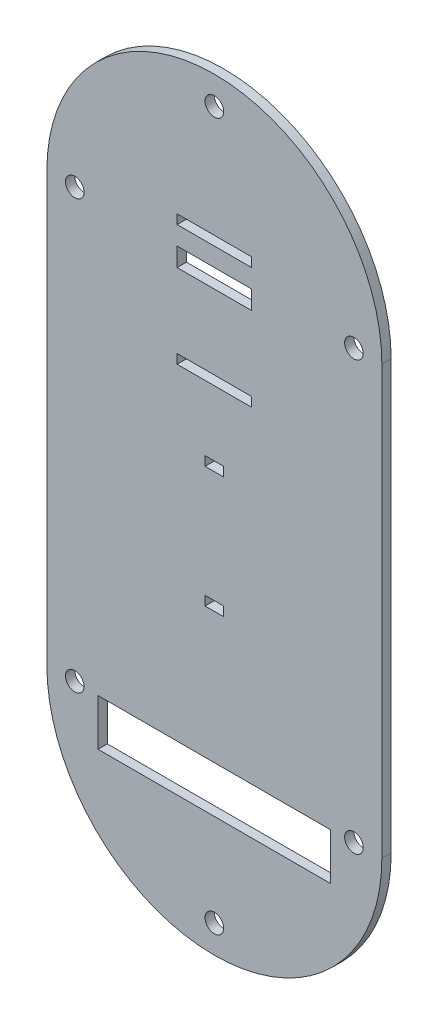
ISO-10303-21;
HEADER;
FILE_DESCRIPTION(('STEP AP214'),'2;1');
FILE_NAME('part.step','',(''),(''),'','','');
FILE_SCHEMA(('AUTOMOTIVE_DESIGN { 1 0 10303 214 1 1 1 1 }'));
ENDSEC;
DATA;
#1=APPLICATION_CONTEXT('core data for automotive mechanical design processes');
#2=APPLICATION_PROTOCOL_DEFINITION('international standard','automotive_design',2000,#1);
#3=PRODUCT_CONTEXT('',#1,'mechanical');
#4=PRODUCT('Part','Part','',(#3));
#5=PRODUCT_RELATED_PRODUCT_CATEGORY('part','',(#4));
#6=PRODUCT_DEFINITION_FORMATION('','',#4);
#7=PRODUCT_DEFINITION_CONTEXT('part definition',#1,'design');
#8=PRODUCT_DEFINITION('design','',#6,#7);
#9=PRODUCT_DEFINITION_SHAPE('','',#8);
#10=(LENGTH_UNIT() NAMED_UNIT(*) SI_UNIT(.MILLI.,.METRE.));
#11=(NAMED_UNIT(*) PLANE_ANGLE_UNIT() SI_UNIT($,.RADIAN.));
#12=(NAMED_UNIT(*) SI_UNIT($,.STERADIAN.) SOLID_ANGLE_UNIT());
#13=UNCERTAINTY_MEASURE_WITH_UNIT(LENGTH_MEASURE(1.E-05),#10,'distance_accuracy_value','');
#14=(GEOMETRIC_REPRESENTATION_CONTEXT(3) GLOBAL_UNCERTAINTY_ASSIGNED_CONTEXT((#13)) GLOBAL_UNIT_ASSIGNED_CONTEXT((#10,
#11,#12)) REPRESENTATION_CONTEXT('',''));
#15=CARTESIAN_POINT('',(0.,0.,0.));
#16=DIRECTION('',(0.,0.,1.));
#17=DIRECTION('',(1.,0.,0.));
#18=AXIS2_PLACEMENT_3D('',#15,#16,#17);
#19=CARTESIAN_POINT('',(36.649839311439,34.5117384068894,3.175));
#20=DIRECTION('',(0.,0.,1.));
#21=DIRECTION('',(1.,0.,0.));
#22=AXIS2_PLACEMENT_3D('',#19,#20,#21);
#23=PLANE('',#22);
#24=DIRECTION('',(-1.,0.,0.));
#25=VECTOR('',#24,1.);
#26=CARTESIAN_POINT('',(39.824839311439,-63.9132615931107,3.175));
#27=LINE('',#26,#25);
#28=CARTESIAN_POINT('',(39.824839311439,-63.9132615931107,3.175));
#29=VERTEX_POINT('',#28);
#30=CARTESIAN_POINT('',(33.474839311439,-63.9132615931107,3.175));
#31=VERTEX_POINT('',#30);
#32=EDGE_CURVE('E256',#29,#31,#27,.T.);
#33=ORIENTED_EDGE('',*,*,#32,.F.);
#34=DIRECTION('',(0.,1.,0.));
#35=VECTOR('',#34,1.);
#36=CARTESIAN_POINT('',(39.824839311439,-63.9132615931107,3.175));
#37=LINE('',#36,#35);
#38=CARTESIAN_POINT('',(39.824839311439,-67.0882615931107,3.175));
#39=VERTEX_POINT('',#38);
#40=EDGE_CURVE('E254',#39,#29,#37,.T.);
#41=ORIENTED_EDGE('',*,*,#40,.F.);
#42=DIRECTION('',(1.,0.,0.));
#43=VECTOR('',#42,1.);
#44=CARTESIAN_POINT('',(39.824839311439,-67.0882615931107,3.175));
#45=LINE('',#44,#43);
#46=CARTESIAN_POINT('',(33.474839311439,-67.0882615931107,3.175));
#47=VERTEX_POINT('',#46);
#48=EDGE_CURVE('E262',#47,#39,#45,.T.);
#49=ORIENTED_EDGE('',*,*,#48,.F.);
#50=DIRECTION('',(0.,-1.,0.));
#51=VECTOR('',#50,1.);
#52=CARTESIAN_POINT('',(33.474839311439,-63.9132615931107,3.175));
#53=LINE('',#52,#51);
#54=EDGE_CURVE('E259',#31,#47,#53,.T.);
#55=ORIENTED_EDGE('',*,*,#54,.F.);
#56=EDGE_LOOP('',(#33,#41,#49,#55));
#57=FACE_BOUND('',#56,.T.);
#58=DIRECTION('',(-1.,0.,0.));
#59=VECTOR('',#58,1.);
#60=CARTESIAN_POINT('',(49.3498393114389,34.5117384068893,3.175));
#61=LINE('',#60,#59);
#62=CARTESIAN_POINT('',(49.3498393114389,34.5117384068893,3.175));
#63=VERTEX_POINT('',#62);
#64=CARTESIAN_POINT('',(23.949839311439,34.5117384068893,3.175));
#65=VERTEX_POINT('',#64);
#66=EDGE_CURVE('E318',#63,#65,#61,.T.);
#67=ORIENTED_EDGE('',*,*,#66,.F.);
#68=DIRECTION('',(0.,1.,0.));
#69=VECTOR('',#68,1.);
#70=CARTESIAN_POINT('',(49.3498393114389,34.5117384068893,3.175));
#71=LINE('',#70,#69);
#72=CARTESIAN_POINT('',(49.349839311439,28.1617384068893,3.175));
#73=VERTEX_POINT('',#72);
#74=EDGE_CURVE('E316',#73,#63,#71,.T.);
#75=ORIENTED_EDGE('',*,*,#74,.F.);
#76=DIRECTION('',(1.,0.,0.));
#77=VECTOR('',#76,1.);
#78=CARTESIAN_POINT('',(49.349839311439,28.1617384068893,3.175));
#79=LINE('',#78,#77);
#80=CARTESIAN_POINT('',(23.949839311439,28.1617384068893,3.175));
#81=VERTEX_POINT('',#80);
#82=EDGE_CURVE('E324',#81,#73,#79,.T.);
#83=ORIENTED_EDGE('',*,*,#82,.F.);
#84=DIRECTION('',(0.,-1.,0.));
#85=VECTOR('',#84,1.);
#86=CARTESIAN_POINT('',(23.949839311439,34.5117384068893,3.175));
#87=LINE('',#86,#85);
#88=EDGE_CURVE('E321',#65,#81,#87,.T.);
#89=ORIENTED_EDGE('',*,*,#88,.F.);
#90=EDGE_LOOP('',(#67,#75,#83,#89));
#91=FACE_BOUND('',#90,.T.);
#92=CARTESIAN_POINT('',(84.274839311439,-111.538261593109,3.175));
#93=DIRECTION('',(0.,0.,1.));
#94=DIRECTION('',(1.,0.,0.));
#95=AXIS2_PLACEMENT_3D('',#92,#93,#94);
#96=CIRCLE('',#95,3.17499999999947);
#97=CARTESIAN_POINT('',(87.4498393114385,-111.538261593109,3.175));
#98=VERTEX_POINT('',#97);
#99=EDGE_CURVE('E353',#98,#98,#96,.T.);
#100=ORIENTED_EDGE('',*,*,#99,.F.);
#101=EDGE_LOOP('',(#100));
#102=FACE_BOUND('',#101,.T.);
#103=CARTESIAN_POINT('',(-10.975160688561,34.5117384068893,3.175));
#104=DIRECTION('',(0.,0.,1.));
#105=DIRECTION('',(1.,0.,0.));
#106=AXIS2_PLACEMENT_3D('',#103,#104,#105);
#107=CIRCLE('',#106,3.17500000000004);
#108=CARTESIAN_POINT('',(-7.80016068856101,34.5117384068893,3.175));
#109=VERTEX_POINT('',#108);
#110=EDGE_CURVE('E365',#109,#109,#107,.T.);
#111=ORIENTED_EDGE('',*,*,#110,.F.);
#112=EDGE_LOOP('',(#111));
#113=FACE_BOUND('',#112,.T.);
#114=CARTESIAN_POINT('',(36.6498393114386,82.1367384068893,3.175));
#115=DIRECTION('',(0.,0.,1.));
#116=DIRECTION('',(1.,0.,0.));
#117=AXIS2_PLACEMENT_3D('',#114,#115,#116);
#118=CIRCLE('',#117,3.17500000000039);
#119=CARTESIAN_POINT('',(39.824839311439,82.1367384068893,3.175));
#120=VERTEX_POINT('',#119);
#121=EDGE_CURVE('E377',#120,#120,#118,.T.);
#122=ORIENTED_EDGE('',*,*,#121,.F.);
#123=EDGE_LOOP('',(#122));
#124=FACE_BOUND('',#123,.T.);
#125=DIRECTION('',(-1.,0.,0.));
#126=VECTOR('',#125,1.);
#127=CARTESIAN_POINT('',(49.349839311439,44.0367384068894,3.175));
#128=LINE('',#127,#126);
#129=CARTESIAN_POINT('',(49.349839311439,44.0367384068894,3.175));
#130=VERTEX_POINT('',#129);
#131=CARTESIAN_POINT('',(23.9498393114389,44.0367384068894,3.175));
#132=VERTEX_POINT('',#131);
#133=EDGE_CURVE('E416',#130,#132,#128,.T.);
#134=ORIENTED_EDGE('',*,*,#133,.F.);
#135=DIRECTION('',(0.,1.,0.));
#136=VECTOR('',#135,1.);
#137=CARTESIAN_POINT('',(49.349839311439,44.0367384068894,3.175));
#138=LINE('',#137,#136);
#139=CARTESIAN_POINT('',(49.3498393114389,40.8617384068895,3.175));
#140=VERTEX_POINT('',#139);
#141=EDGE_CURVE('E414',#140,#130,#138,.T.);
#142=ORIENTED_EDGE('',*,*,#141,.F.);
#143=DIRECTION('',(1.,0.,0.));
#144=VECTOR('',#143,1.);
#145=CARTESIAN_POINT('',(49.3498393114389,40.8617384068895,3.175));
#146=LINE('',#145,#144);
#147=CARTESIAN_POINT('',(23.949839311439,40.8617384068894,3.175));
#148=VERTEX_POINT('',#147);
#149=EDGE_CURVE('E422',#148,#140,#146,.T.);
#150=ORIENTED_EDGE('',*,*,#149,.F.);
#151=DIRECTION('',(0.,-1.,0.));
#152=VECTOR('',#151,1.);
#153=CARTESIAN_POINT('',(23.9498393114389,44.0367384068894,3.175));
#154=LINE('',#153,#152);
#155=EDGE_CURVE('E419',#132,#148,#154,.T.);
#156=ORIENTED_EDGE('',*,*,#155,.F.);
#157=EDGE_LOOP('',(#134,#142,#150,#156));
#158=FACE_BOUND('',#157,.T.);
#159=CARTESIAN_POINT('',(36.649839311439,34.5117384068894,3.175));
#160=DIRECTION('',(0.,0.,1.));
#161=DIRECTION('',(1.,0.,0.));
#162=AXIS2_PLACEMENT_3D('',#159,#160,#161);
#163=CIRCLE('',#162,57.15);
#164=CARTESIAN_POINT('',(93.799839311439,34.5117384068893,3.175));
#165=VERTEX_POINT('',#164);
#166=CARTESIAN_POINT('',(-20.500160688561,34.5117384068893,3.175));
#167=VERTEX_POINT('',#166);
#168=EDGE_CURVE('E445',#165,#167,#163,.T.);
#169=ORIENTED_EDGE('',*,*,#168,.T.);
#170=DIRECTION('',(0.,-1.,0.));
#171=VECTOR('',#170,1.);
#172=CARTESIAN_POINT('',(-20.500160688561,34.5117384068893,3.175));
#173=LINE('',#172,#171);
#174=CARTESIAN_POINT('',(-20.500160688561,-111.538261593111,3.175));
#175=VERTEX_POINT('',#174);
#176=EDGE_CURVE('E448',#167,#175,#173,.T.);
#177=ORIENTED_EDGE('',*,*,#176,.T.);
#178=CARTESIAN_POINT('',(36.649839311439,-111.538261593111,3.175));
#179=DIRECTION('',(0.,0.,1.));
#180=DIRECTION('',(1.,0.,0.));
#181=AXIS2_PLACEMENT_3D('',#178,#179,#180);
#182=CIRCLE('',#181,57.15);
#183=CARTESIAN_POINT('',(93.799839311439,-111.538261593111,3.175));
#184=VERTEX_POINT('',#183);
#185=EDGE_CURVE('E451',#175,#184,#182,.T.);
#186=ORIENTED_EDGE('',*,*,#185,.T.);
#187=DIRECTION('',(0.,1.,0.));
#188=VECTOR('',#187,1.);
#189=CARTESIAN_POINT('',(93.799839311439,34.5117384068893,3.175));
#190=LINE('',#189,#188);
#191=EDGE_CURVE('E453',#184,#165,#190,.T.);
#192=ORIENTED_EDGE('',*,*,#191,.T.);
#193=EDGE_LOOP('',(#169,#177,#186,#192));
#194=FACE_BOUND('',#193,.T.);
#195=DIRECTION('',(-1.,0.,0.));
#196=VECTOR('',#195,1.);
#197=CARTESIAN_POINT('',(49.3498393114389,2.76173840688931,3.175));
#198=LINE('',#197,#196);
#199=CARTESIAN_POINT('',(49.3498393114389,2.76173840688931,3.175));
#200=VERTEX_POINT('',#199);
#201=CARTESIAN_POINT('',(23.9498393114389,2.76173840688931,3.175));
#202=VERTEX_POINT('',#201);
#203=EDGE_CURVE('E385',#200,#202,#198,.T.);
#204=ORIENTED_EDGE('',*,*,#203,.F.);
#205=DIRECTION('',(0.,1.,0.));
#206=VECTOR('',#205,1.);
#207=CARTESIAN_POINT('',(49.3498393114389,2.76173840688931,3.175));
#208=LINE('',#207,#206);
#209=CARTESIAN_POINT('',(49.3498393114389,-0.413261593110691,3.175));
#210=VERTEX_POINT('',#209);
#211=EDGE_CURVE('E383',#210,#200,#208,.T.);
#212=ORIENTED_EDGE('',*,*,#211,.F.);
#213=DIRECTION('',(1.,0.,0.));
#214=VECTOR('',#213,1.);
#215=CARTESIAN_POINT('',(49.3498393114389,-0.413261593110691,3.175));
#216=LINE('',#215,#214);
#217=CARTESIAN_POINT('',(23.9498393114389,-0.413261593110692,3.175));
#218=VERTEX_POINT('',#217);
#219=EDGE_CURVE('E391',#218,#210,#216,.T.);
#220=ORIENTED_EDGE('',*,*,#219,.F.);
#221=DIRECTION('',(0.,-1.,0.));
#222=VECTOR('',#221,1.);
#223=CARTESIAN_POINT('',(23.9498393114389,2.76173840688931,3.175));
#224=LINE('',#223,#222);
#225=EDGE_CURVE('E388',#202,#218,#224,.T.);
#226=ORIENTED_EDGE('',*,*,#225,.F.);
#227=EDGE_LOOP('',(#204,#212,#220,#226));
#228=FACE_BOUND('',#227,.T.);
#229=CARTESIAN_POINT('',(84.274839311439,34.5117384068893,3.175));
#230=DIRECTION('',(0.,0.,1.));
#231=DIRECTION('',(1.,0.,0.));
#232=AXIS2_PLACEMENT_3D('',#229,#230,#231);
#233=CIRCLE('',#232,3.17500000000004);
#234=CARTESIAN_POINT('',(87.449839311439,34.5117384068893,3.175));
#235=VERTEX_POINT('',#234);
#236=EDGE_CURVE('E371',#235,#235,#233,.T.);
#237=ORIENTED_EDGE('',*,*,#236,.F.);
#238=EDGE_LOOP('',(#237));
#239=FACE_BOUND('',#238,.T.);
#240=CARTESIAN_POINT('',(-10.975160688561,-111.538261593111,3.175));
#241=DIRECTION('',(0.,0.,1.));
#242=DIRECTION('',(1.,0.,0.));
#243=AXIS2_PLACEMENT_3D('',#240,#241,#242);
#244=CIRCLE('',#243,3.17500000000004);
#245=CARTESIAN_POINT('',(-7.80016068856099,-111.538261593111,3.175));
#246=VERTEX_POINT('',#245);
#247=EDGE_CURVE('E359',#246,#246,#244,.T.);
#248=ORIENTED_EDGE('',*,*,#247,.F.);
#249=EDGE_LOOP('',(#248));
#250=FACE_BOUND('',#249,.T.);
#251=CARTESIAN_POINT('',(36.6498393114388,-159.163261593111,3.175));
#252=DIRECTION('',(0.,0.,1.));
#253=DIRECTION('',(1.,0.,0.));
#254=AXIS2_PLACEMENT_3D('',#251,#252,#253);
#255=CIRCLE('',#254,3.1750000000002);
#256=CARTESIAN_POINT('',(39.824839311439,-159.163261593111,3.175));
#257=VERTEX_POINT('',#256);
#258=EDGE_CURVE('E347',#257,#257,#255,.T.);
#259=ORIENTED_EDGE('',*,*,#258,.F.);
#260=EDGE_LOOP('',(#259));
#261=FACE_BOUND('',#260,.T.);
#262=DIRECTION('',(-1.,0.,0.));
#263=VECTOR('',#262,1.);
#264=CARTESIAN_POINT('',(39.824839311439,-22.6382615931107,3.175));
#265=LINE('',#264,#263);
#266=CARTESIAN_POINT('',(39.824839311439,-22.6382615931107,3.175));
#267=VERTEX_POINT('',#266);
#268=CARTESIAN_POINT('',(33.474839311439,-22.6382615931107,3.175));
#269=VERTEX_POINT('',#268);
#270=EDGE_CURVE('E287',#267,#269,#265,.T.);
#271=ORIENTED_EDGE('',*,*,#270,.F.);
#272=DIRECTION('',(0.,1.,0.));
#273=VECTOR('',#272,1.);
#274=CARTESIAN_POINT('',(39.824839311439,-22.6382615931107,3.175));
#275=LINE('',#274,#273);
#276=CARTESIAN_POINT('',(39.824839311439,-25.8132615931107,3.175));
#277=VERTEX_POINT('',#276);
#278=EDGE_CURVE('E285',#277,#267,#275,.T.);
#279=ORIENTED_EDGE('',*,*,#278,.F.);
#280=DIRECTION('',(1.,0.,0.));
#281=VECTOR('',#280,1.);
#282=CARTESIAN_POINT('',(39.824839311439,-25.8132615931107,3.175));
#283=LINE('',#282,#281);
#284=CARTESIAN_POINT('',(33.474839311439,-25.8132615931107,3.175));
#285=VERTEX_POINT('',#284);
#286=EDGE_CURVE('E293',#285,#277,#283,.T.);
#287=ORIENTED_EDGE('',*,*,#286,.F.);
#288=DIRECTION('',(0.,-1.,0.));
#289=VECTOR('',#288,1.);
#290=CARTESIAN_POINT('',(33.474839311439,-22.6382615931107,3.175));
#291=LINE('',#290,#289);
#292=EDGE_CURVE('E290',#269,#285,#291,.T.);
#293=ORIENTED_EDGE('',*,*,#292,.F.);
#294=EDGE_LOOP('',(#271,#279,#287,#293));
#295=FACE_BOUND('',#294,.T.);
#296=DIRECTION('',(-1.,0.,0.));
#297=VECTOR('',#296,1.);
#298=CARTESIAN_POINT('',(76.337339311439,-111.791336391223,3.175));
#299=LINE('',#298,#297);
#300=CARTESIAN_POINT('',(76.337339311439,-111.791336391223,3.175));
#301=VERTEX_POINT('',#300);
#302=CARTESIAN_POINT('',(-3.037660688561,-111.791336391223,3.175));
#303=VERTEX_POINT('',#302);
#304=EDGE_CURVE('E226',#301,#303,#299,.T.);
#305=ORIENTED_EDGE('',*,*,#304,.F.);
#306=DIRECTION('',(0.,1.,0.));
#307=VECTOR('',#306,1.);
#308=CARTESIAN_POINT('',(76.337339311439,-111.791336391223,3.175));
#309=LINE('',#308,#307);
#310=CARTESIAN_POINT('',(76.337339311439,-127.666336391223,3.175));
#311=VERTEX_POINT('',#310);
#312=EDGE_CURVE('E218',#311,#301,#309,.T.);
#313=ORIENTED_EDGE('',*,*,#312,.F.);
#314=DIRECTION('',(1.,0.,0.));
#315=VECTOR('',#314,1.);
#316=CARTESIAN_POINT('',(76.337339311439,-127.666336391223,3.175));
#317=LINE('',#316,#315);
#318=CARTESIAN_POINT('',(-3.037660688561,-127.666336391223,3.175));
#319=VERTEX_POINT('',#318);
#320=EDGE_CURVE('E240',#319,#311,#317,.T.);
#321=ORIENTED_EDGE('',*,*,#320,.F.);
#322=DIRECTION('',(0.,-1.,0.));
#323=VECTOR('',#322,1.);
#324=CARTESIAN_POINT('',(-3.037660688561,-111.791336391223,3.175));
#325=LINE('',#324,#323);
#326=EDGE_CURVE('E238',#303,#319,#325,.T.);
#327=ORIENTED_EDGE('',*,*,#326,.F.);
#328=EDGE_LOOP('',(#305,#313,#321,#327));
#329=FACE_BOUND('',#328,.T.);
#330=ADVANCED_FACE('F33',(#57,#91,#102,#113,#124,#158,#194,#228,#239,#250,#261,#295,#329),#23,.T.);
#331=CARTESIAN_POINT('',(36.649839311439,34.5117384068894,0.));
#332=DIRECTION('',(0.,0.,1.));
#333=DIRECTION('',(1.,0.,0.));
#334=AXIS2_PLACEMENT_3D('',#331,#332,#333);
#335=PLANE('',#334);
#336=DIRECTION('',(0.,1.,0.));
#337=VECTOR('',#336,1.);
#338=CARTESIAN_POINT('',(39.824839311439,-63.9132615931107,0.));
#339=LINE('',#338,#337);
#340=CARTESIAN_POINT('',(39.824839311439,-67.0882615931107,0.));
#341=VERTEX_POINT('',#340);
#342=CARTESIAN_POINT('',(39.824839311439,-63.9132615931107,0.));
#343=VERTEX_POINT('',#342);
#344=EDGE_CURVE('E234',#341,#343,#339,.T.);
#345=ORIENTED_EDGE('',*,*,#344,.T.);
#346=DIRECTION('',(-1.,0.,0.));
#347=VECTOR('',#346,1.);
#348=CARTESIAN_POINT('',(39.824839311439,-63.9132615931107,0.));
#349=LINE('',#348,#347);
#350=CARTESIAN_POINT('',(33.474839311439,-63.9132615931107,0.));
#351=VERTEX_POINT('',#350);
#352=EDGE_CURVE('E267',#343,#351,#349,.T.);
#353=ORIENTED_EDGE('',*,*,#352,.T.);
#354=DIRECTION('',(0.,-1.,0.));
#355=VECTOR('',#354,1.);
#356=CARTESIAN_POINT('',(33.474839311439,-63.9132615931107,0.));
#357=LINE('',#356,#355);
#358=CARTESIAN_POINT('',(33.474839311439,-67.0882615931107,0.));
#359=VERTEX_POINT('',#358);
#360=EDGE_CURVE('E270',#351,#359,#357,.T.);
#361=ORIENTED_EDGE('',*,*,#360,.T.);
#362=DIRECTION('',(1.,0.,0.));
#363=VECTOR('',#362,1.);
#364=CARTESIAN_POINT('',(39.824839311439,-67.0882615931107,0.));
#365=LINE('',#364,#363);
#366=EDGE_CURVE('E257',#359,#341,#365,.T.);
#367=ORIENTED_EDGE('',*,*,#366,.T.);
#368=EDGE_LOOP('',(#345,#353,#361,#367));
#369=FACE_BOUND('',#368,.T.);
#370=DIRECTION('',(0.,1.,0.));
#371=VECTOR('',#370,1.);
#372=CARTESIAN_POINT('',(49.3498393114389,34.5117384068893,0.));
#373=LINE('',#372,#371);
#374=CARTESIAN_POINT('',(49.349839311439,28.1617384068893,0.));
#375=VERTEX_POINT('',#374);
#376=CARTESIAN_POINT('',(49.3498393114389,34.5117384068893,0.));
#377=VERTEX_POINT('',#376);
#378=EDGE_CURVE('E315',#375,#377,#373,.T.);
#379=ORIENTED_EDGE('',*,*,#378,.T.);
#380=DIRECTION('',(-1.,0.,0.));
#381=VECTOR('',#380,1.);
#382=CARTESIAN_POINT('',(49.3498393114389,34.5117384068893,0.));
#383=LINE('',#382,#381);
#384=CARTESIAN_POINT('',(23.949839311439,34.5117384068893,0.));
#385=VERTEX_POINT('',#384);
#386=EDGE_CURVE('E329',#377,#385,#383,.T.);
#387=ORIENTED_EDGE('',*,*,#386,.T.);
#388=DIRECTION('',(0.,-1.,0.));
#389=VECTOR('',#388,1.);
#390=CARTESIAN_POINT('',(23.949839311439,34.5117384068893,0.));
#391=LINE('',#390,#389);
#392=CARTESIAN_POINT('',(23.949839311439,28.1617384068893,0.));
#393=VERTEX_POINT('',#392);
#394=EDGE_CURVE('E332',#385,#393,#391,.T.);
#395=ORIENTED_EDGE('',*,*,#394,.T.);
#396=DIRECTION('',(1.,0.,0.));
#397=VECTOR('',#396,1.);
#398=CARTESIAN_POINT('',(49.349839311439,28.1617384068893,0.));
#399=LINE('',#398,#397);
#400=EDGE_CURVE('E319',#393,#375,#399,.T.);
#401=ORIENTED_EDGE('',*,*,#400,.T.);
#402=EDGE_LOOP('',(#379,#387,#395,#401));
#403=FACE_BOUND('',#402,.T.);
#404=CARTESIAN_POINT('',(84.274839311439,-111.538261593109,0.));
#405=DIRECTION('',(0.,0.,1.));
#406=DIRECTION('',(1.,0.,0.));
#407=AXIS2_PLACEMENT_3D('',#404,#405,#406);
#408=CIRCLE('',#407,3.17499999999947);
#409=CARTESIAN_POINT('',(87.4498393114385,-111.538261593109,0.));
#410=VERTEX_POINT('',#409);
#411=EDGE_CURVE('E350',#410,#410,#408,.T.);
#412=ORIENTED_EDGE('',*,*,#411,.T.);
#413=EDGE_LOOP('',(#412));
#414=FACE_BOUND('',#413,.T.);
#415=CARTESIAN_POINT('',(-10.975160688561,34.5117384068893,0.));
#416=DIRECTION('',(0.,0.,1.));
#417=DIRECTION('',(1.,0.,0.));
#418=AXIS2_PLACEMENT_3D('',#415,#416,#417);
#419=CIRCLE('',#418,3.17500000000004);
#420=CARTESIAN_POINT('',(-7.80016068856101,34.5117384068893,0.));
#421=VERTEX_POINT('',#420);
#422=EDGE_CURVE('E362',#421,#421,#419,.T.);
#423=ORIENTED_EDGE('',*,*,#422,.T.);
#424=EDGE_LOOP('',(#423));
#425=FACE_BOUND('',#424,.T.);
#426=CARTESIAN_POINT('',(36.6498393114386,82.1367384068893,0.));
#427=DIRECTION('',(0.,0.,1.));
#428=DIRECTION('',(1.,0.,0.));
#429=AXIS2_PLACEMENT_3D('',#426,#427,#428);
#430=CIRCLE('',#429,3.17500000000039);
#431=CARTESIAN_POINT('',(39.824839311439,82.1367384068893,0.));
#432=VERTEX_POINT('',#431);
#433=EDGE_CURVE('E374',#432,#432,#430,.T.);
#434=ORIENTED_EDGE('',*,*,#433,.T.);
#435=EDGE_LOOP('',(#434));
#436=FACE_BOUND('',#435,.T.);
#437=DIRECTION('',(0.,1.,0.));
#438=VECTOR('',#437,1.);
#439=CARTESIAN_POINT('',(49.349839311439,44.0367384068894,0.));
#440=LINE('',#439,#438);
#441=CARTESIAN_POINT('',(49.3498393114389,40.8617384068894,0.));
#442=VERTEX_POINT('',#441);
#443=CARTESIAN_POINT('',(49.349839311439,44.0367384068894,0.));
#444=VERTEX_POINT('',#443);
#445=EDGE_CURVE('E413',#442,#444,#440,.T.);
#446=ORIENTED_EDGE('',*,*,#445,.T.);
#447=DIRECTION('',(-1.,0.,0.));
#448=VECTOR('',#447,1.);
#449=CARTESIAN_POINT('',(49.349839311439,44.0367384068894,0.));
#450=LINE('',#449,#448);
#451=CARTESIAN_POINT('',(23.9498393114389,44.0367384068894,0.));
#452=VERTEX_POINT('',#451);
#453=EDGE_CURVE('E427',#444,#452,#450,.T.);
#454=ORIENTED_EDGE('',*,*,#453,.T.);
#455=DIRECTION('',(0.,-1.,0.));
#456=VECTOR('',#455,1.);
#457=CARTESIAN_POINT('',(23.9498393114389,44.0367384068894,0.));
#458=LINE('',#457,#456);
#459=CARTESIAN_POINT('',(23.949839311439,40.8617384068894,0.));
#460=VERTEX_POINT('',#459);
#461=EDGE_CURVE('E430',#452,#460,#458,.T.);
#462=ORIENTED_EDGE('',*,*,#461,.T.);
#463=DIRECTION('',(1.,0.,0.));
#464=VECTOR('',#463,1.);
#465=CARTESIAN_POINT('',(49.3498393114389,40.8617384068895,0.));
#466=LINE('',#465,#464);
#467=EDGE_CURVE('E417',#460,#442,#466,.T.);
#468=ORIENTED_EDGE('',*,*,#467,.T.);
#469=EDGE_LOOP('',(#446,#454,#462,#468));
#470=FACE_BOUND('',#469,.T.);
#471=CARTESIAN_POINT('',(36.649839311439,34.5117384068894,0.));
#472=DIRECTION('',(0.,0.,1.));
#473=DIRECTION('',(1.,0.,0.));
#474=AXIS2_PLACEMENT_3D('',#471,#472,#473);
#475=CIRCLE('',#474,57.15);
#476=CARTESIAN_POINT('',(93.799839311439,34.5117384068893,0.));
#477=VERTEX_POINT('',#476);
#478=CARTESIAN_POINT('',(-20.500160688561,34.5117384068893,0.));
#479=VERTEX_POINT('',#478);
#480=EDGE_CURVE('E444',#477,#479,#475,.T.);
#481=ORIENTED_EDGE('',*,*,#480,.F.);
#482=DIRECTION('',(0.,1.,0.));
#483=VECTOR('',#482,1.);
#484=CARTESIAN_POINT('',(93.799839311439,34.5117384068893,0.));
#485=LINE('',#484,#483);
#486=CARTESIAN_POINT('',(93.799839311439,-111.538261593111,0.));
#487=VERTEX_POINT('',#486);
#488=EDGE_CURVE('E449',#487,#477,#485,.T.);
#489=ORIENTED_EDGE('',*,*,#488,.F.);
#490=CARTESIAN_POINT('',(36.649839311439,-111.538261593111,0.));
#491=DIRECTION('',(0.,0.,1.));
#492=DIRECTION('',(1.,0.,0.));
#493=AXIS2_PLACEMENT_3D('',#490,#491,#492);
#494=CIRCLE('',#493,57.15);
#495=CARTESIAN_POINT('',(-20.500160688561,-111.538261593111,0.));
#496=VERTEX_POINT('',#495);
#497=EDGE_CURVE('E460',#496,#487,#494,.T.);
#498=ORIENTED_EDGE('',*,*,#497,.F.);
#499=DIRECTION('',(0.,-1.,0.));
#500=VECTOR('',#499,1.);
#501=CARTESIAN_POINT('',(-20.500160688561,34.5117384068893,0.));
#502=LINE('',#501,#500);
#503=EDGE_CURVE('E458',#479,#496,#502,.T.);
#504=ORIENTED_EDGE('',*,*,#503,.F.);
#505=EDGE_LOOP('',(#481,#489,#498,#504));
#506=FACE_BOUND('',#505,.T.);
#507=DIRECTION('',(0.,1.,0.));
#508=VECTOR('',#507,1.);
#509=CARTESIAN_POINT('',(49.3498393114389,2.76173840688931,0.));
#510=LINE('',#509,#508);
#511=CARTESIAN_POINT('',(49.3498393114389,-0.413261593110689,0.));
#512=VERTEX_POINT('',#511);
#513=CARTESIAN_POINT('',(49.3498393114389,2.76173840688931,0.));
#514=VERTEX_POINT('',#513);
#515=EDGE_CURVE('E380',#512,#514,#510,.T.);
#516=ORIENTED_EDGE('',*,*,#515,.T.);
#517=DIRECTION('',(-1.,0.,0.));
#518=VECTOR('',#517,1.);
#519=CARTESIAN_POINT('',(49.3498393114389,2.76173840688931,0.));
#520=LINE('',#519,#518);
#521=CARTESIAN_POINT('',(23.9498393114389,2.76173840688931,0.));
#522=VERTEX_POINT('',#521);
#523=EDGE_CURVE('E396',#514,#522,#520,.T.);
#524=ORIENTED_EDGE('',*,*,#523,.T.);
#525=DIRECTION('',(0.,-1.,0.));
#526=VECTOR('',#525,1.);
#527=CARTESIAN_POINT('',(23.9498393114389,2.76173840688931,0.));
#528=LINE('',#527,#526);
#529=CARTESIAN_POINT('',(23.9498393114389,-0.413261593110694,0.));
#530=VERTEX_POINT('',#529);
#531=EDGE_CURVE('E399',#522,#530,#528,.T.);
#532=ORIENTED_EDGE('',*,*,#531,.T.);
#533=DIRECTION('',(1.,0.,0.));
#534=VECTOR('',#533,1.);
#535=CARTESIAN_POINT('',(49.3498393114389,-0.413261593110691,0.));
#536=LINE('',#535,#534);
#537=EDGE_CURVE('E386',#530,#512,#536,.T.);
#538=ORIENTED_EDGE('',*,*,#537,.T.);
#539=EDGE_LOOP('',(#516,#524,#532,#538));
#540=FACE_BOUND('',#539,.T.);
#541=CARTESIAN_POINT('',(84.274839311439,34.5117384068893,0.));
#542=DIRECTION('',(0.,0.,1.));
#543=DIRECTION('',(1.,0.,0.));
#544=AXIS2_PLACEMENT_3D('',#541,#542,#543);
#545=CIRCLE('',#544,3.17500000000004);
#546=CARTESIAN_POINT('',(87.449839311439,34.5117384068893,0.));
#547=VERTEX_POINT('',#546);
#548=EDGE_CURVE('E368',#547,#547,#545,.T.);
#549=ORIENTED_EDGE('',*,*,#548,.T.);
#550=EDGE_LOOP('',(#549));
#551=FACE_BOUND('',#550,.T.);
#552=CARTESIAN_POINT('',(-10.975160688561,-111.538261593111,0.));
#553=DIRECTION('',(0.,0.,1.));
#554=DIRECTION('',(1.,0.,0.));
#555=AXIS2_PLACEMENT_3D('',#552,#553,#554);
#556=CIRCLE('',#555,3.17500000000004);
#557=CARTESIAN_POINT('',(-7.80016068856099,-111.538261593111,0.));
#558=VERTEX_POINT('',#557);
#559=EDGE_CURVE('E356',#558,#558,#556,.T.);
#560=ORIENTED_EDGE('',*,*,#559,.T.);
#561=EDGE_LOOP('',(#560));
#562=FACE_BOUND('',#561,.T.);
#563=CARTESIAN_POINT('',(36.6498393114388,-159.163261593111,0.));
#564=DIRECTION('',(0.,0.,1.));
#565=DIRECTION('',(1.,0.,0.));
#566=AXIS2_PLACEMENT_3D('',#563,#564,#565);
#567=CIRCLE('',#566,3.1750000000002);
#568=CARTESIAN_POINT('',(39.824839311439,-159.163261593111,0.));
#569=VERTEX_POINT('',#568);
#570=EDGE_CURVE('E346',#569,#569,#567,.T.);
#571=ORIENTED_EDGE('',*,*,#570,.T.);
#572=EDGE_LOOP('',(#571));
#573=FACE_BOUND('',#572,.T.);
#574=DIRECTION('',(0.,1.,0.));
#575=VECTOR('',#574,1.);
#576=CARTESIAN_POINT('',(39.824839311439,-22.6382615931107,0.));
#577=LINE('',#576,#575);
#578=CARTESIAN_POINT('',(39.824839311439,-25.8132615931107,0.));
#579=VERTEX_POINT('',#578);
#580=CARTESIAN_POINT('',(39.824839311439,-22.6382615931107,0.));
#581=VERTEX_POINT('',#580);
#582=EDGE_CURVE('E284',#579,#581,#577,.T.);
#583=ORIENTED_EDGE('',*,*,#582,.T.);
#584=DIRECTION('',(-1.,0.,0.));
#585=VECTOR('',#584,1.);
#586=CARTESIAN_POINT('',(39.824839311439,-22.6382615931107,0.));
#587=LINE('',#586,#585);
#588=CARTESIAN_POINT('',(33.474839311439,-22.6382615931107,0.));
#589=VERTEX_POINT('',#588);
#590=EDGE_CURVE('E298',#581,#589,#587,.T.);
#591=ORIENTED_EDGE('',*,*,#590,.T.);
#592=DIRECTION('',(0.,-1.,0.));
#593=VECTOR('',#592,1.);
#594=CARTESIAN_POINT('',(33.474839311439,-22.6382615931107,0.));
#595=LINE('',#594,#593);
#596=CARTESIAN_POINT('',(33.474839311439,-25.8132615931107,0.));
#597=VERTEX_POINT('',#596);
#598=EDGE_CURVE('E301',#589,#597,#595,.T.);
#599=ORIENTED_EDGE('',*,*,#598,.T.);
#600=DIRECTION('',(1.,0.,0.));
#601=VECTOR('',#600,1.);
#602=CARTESIAN_POINT('',(39.824839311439,-25.8132615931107,0.));
#603=LINE('',#602,#601);
#604=EDGE_CURVE('E288',#597,#579,#603,.T.);
#605=ORIENTED_EDGE('',*,*,#604,.T.);
#606=EDGE_LOOP('',(#583,#591,#599,#605));
#607=FACE_BOUND('',#606,.T.);
#608=DIRECTION('',(0.,1.,0.));
#609=VECTOR('',#608,1.);
#610=CARTESIAN_POINT('',(76.337339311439,-111.791336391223,0.));
#611=LINE('',#610,#609);
#612=CARTESIAN_POINT('',(76.337339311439,-127.666336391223,0.));
#613=VERTEX_POINT('',#612);
#614=CARTESIAN_POINT('',(76.337339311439,-111.791336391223,0.));
#615=VERTEX_POINT('',#614);
#616=EDGE_CURVE('E56',#613,#615,#611,.T.);
#617=ORIENTED_EDGE('',*,*,#616,.T.);
#618=DIRECTION('',(-1.,0.,0.));
#619=VECTOR('',#618,1.);
#620=CARTESIAN_POINT('',(76.337339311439,-111.791336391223,0.));
#621=LINE('',#620,#619);
#622=CARTESIAN_POINT('',(-3.037660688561,-111.791336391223,0.));
#623=VERTEX_POINT('',#622);
#624=EDGE_CURVE('E233',#615,#623,#621,.T.);
#625=ORIENTED_EDGE('',*,*,#624,.T.);
#626=DIRECTION('',(0.,-1.,0.));
#627=VECTOR('',#626,1.);
#628=CARTESIAN_POINT('',(-3.037660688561,-111.791336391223,0.));
#629=LINE('',#628,#627);
#630=CARTESIAN_POINT('',(-3.037660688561,-127.666336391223,0.));
#631=VERTEX_POINT('',#630);
#632=EDGE_CURVE('E246',#623,#631,#629,.T.);
#633=ORIENTED_EDGE('',*,*,#632,.T.);
#634=DIRECTION('',(1.,0.,0.));
#635=VECTOR('',#634,1.);
#636=CARTESIAN_POINT('',(76.337339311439,-127.666336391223,0.));
#637=LINE('',#636,#635);
#638=EDGE_CURVE('E227',#631,#613,#637,.T.);
#639=ORIENTED_EDGE('',*,*,#638,.T.);
#640=EDGE_LOOP('',(#617,#625,#633,#639));
#641=FACE_BOUND('',#640,.T.);
#642=ADVANCED_FACE('F478',(#369,#403,#414,#425,#436,#470,#506,#540,#551,#562,#573,#607,#641),
#335,.F.);
#643=CARTESIAN_POINT('',(36.649839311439,34.5117384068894,3.175));
#644=DIRECTION('',(0.,0.,-1.));
#645=DIRECTION('',(-1.,0.,0.));
#646=AXIS2_PLACEMENT_3D('',#643,#644,#645);
#647=CYLINDRICAL_SURFACE('',#646,57.15);
#648=ORIENTED_EDGE('',*,*,#480,.T.);
#649=DIRECTION('',(0.,0.,-1.));
#650=VECTOR('',#649,1.);
#651=CARTESIAN_POINT('',(-20.500160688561,34.5117384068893,3.175));
#652=LINE('',#651,#650);
#653=EDGE_CURVE('E11',#167,#479,#652,.T.);
#654=ORIENTED_EDGE('',*,*,#653,.F.);
#655=ORIENTED_EDGE('',*,*,#168,.F.);
#656=DIRECTION('',(0.,0.,-1.));
#657=VECTOR('',#656,1.);
#658=CARTESIAN_POINT('',(93.799839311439,34.5117384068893,3.175));
#659=LINE('',#658,#657);
#660=EDGE_CURVE('E455',#165,#477,#659,.T.);
#661=ORIENTED_EDGE('',*,*,#660,.T.);
#662=EDGE_LOOP('',(#648,#654,#655,#661));
#663=FACE_BOUND('',#662,.T.);
#664=ADVANCED_FACE('F35',(#663),#647,.T.);
#665=CARTESIAN_POINT('',(-20.500160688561,34.5117384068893,3.175));
#666=DIRECTION('',(1.,0.,0.));
#667=DIRECTION('',(0.,1.,0.));
#668=AXIS2_PLACEMENT_3D('',#665,#666,#667);
#669=PLANE('',#668);
#670=ORIENTED_EDGE('',*,*,#503,.T.);
#671=DIRECTION('',(0.,0.,-1.));
#672=VECTOR('',#671,1.);
#673=CARTESIAN_POINT('',(-20.500160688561,-111.538261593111,3.175));
#674=LINE('',#673,#672);
#675=EDGE_CURVE('E41',#175,#496,#674,.T.);
#676=ORIENTED_EDGE('',*,*,#675,.F.);
#677=ORIENTED_EDGE('',*,*,#176,.F.);
#678=ORIENTED_EDGE('',*,*,#653,.T.);
#679=EDGE_LOOP('',(#670,#676,#677,#678));
#680=FACE_BOUND('',#679,.T.);
#681=ADVANCED_FACE('F489',(#680),#669,.F.);
#682=CARTESIAN_POINT('',(36.649839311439,-111.538261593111,3.175));
#683=DIRECTION('',(0.,0.,-1.));
#684=DIRECTION('',(-1.,0.,0.));
#685=AXIS2_PLACEMENT_3D('',#682,#683,#684);
#686=CYLINDRICAL_SURFACE('',#685,57.15);
#687=ORIENTED_EDGE('',*,*,#497,.T.);
#688=DIRECTION('',(0.,0.,-1.));
#689=VECTOR('',#688,1.);
#690=CARTESIAN_POINT('',(93.799839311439,-111.538261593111,3.175));
#691=LINE('',#690,#689);
#692=EDGE_CURVE('E465',#184,#487,#691,.T.);
#693=ORIENTED_EDGE('',*,*,#692,.F.);
#694=ORIENTED_EDGE('',*,*,#185,.F.);
#695=ORIENTED_EDGE('',*,*,#675,.T.);
#696=EDGE_LOOP('',(#687,#693,#694,#695));
#697=FACE_BOUND('',#696,.T.);
#698=ADVANCED_FACE('F472',(#697),#686,.T.);
#699=CARTESIAN_POINT('',(93.799839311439,34.5117384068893,3.175));
#700=DIRECTION('',(-1.,0.,0.));
#701=DIRECTION('',(0.,-1.,0.));
#702=AXIS2_PLACEMENT_3D('',#699,#700,#701);
#703=PLANE('',#702);
#704=ORIENTED_EDGE('',*,*,#488,.T.);
#705=ORIENTED_EDGE('',*,*,#660,.F.);
#706=ORIENTED_EDGE('',*,*,#191,.F.);
#707=ORIENTED_EDGE('',*,*,#692,.T.);
#708=EDGE_LOOP('',(#704,#705,#706,#707));
#709=FACE_BOUND('',#708,.T.);
#710=ADVANCED_FACE('F482',(#709),#703,.F.);
#711=CARTESIAN_POINT('',(49.349839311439,44.0367384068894,3.175));
#712=DIRECTION('',(-1.,0.,0.));
#713=DIRECTION('',(0.,-1.,0.));
#714=AXIS2_PLACEMENT_3D('',#711,#712,#713);
#715=PLANE('',#714);
#716=ORIENTED_EDGE('',*,*,#445,.F.);
#717=DIRECTION('',(0.,0.,-1.));
#718=VECTOR('',#717,1.);
#719=CARTESIAN_POINT('',(49.3498393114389,40.8617384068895,3.175));
#720=LINE('',#719,#718);
#721=EDGE_CURVE('E424',#140,#442,#720,.T.);
#722=ORIENTED_EDGE('',*,*,#721,.F.);
#723=ORIENTED_EDGE('',*,*,#141,.T.);
#724=DIRECTION('',(0.,0.,-1.));
#725=VECTOR('',#724,1.);
#726=CARTESIAN_POINT('',(49.349839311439,44.0367384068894,3.175));
#727=LINE('',#726,#725);
#728=EDGE_CURVE('E441',#130,#444,#727,.T.);
#729=ORIENTED_EDGE('',*,*,#728,.T.);
#730=EDGE_LOOP('',(#716,#722,#723,#729));
#731=FACE_BOUND('',#730,.T.);
#732=ADVANCED_FACE('F507',(#731),#715,.T.);
#733=CARTESIAN_POINT('',(49.349839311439,44.0367384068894,3.175));
#734=DIRECTION('',(0.,-1.,0.));
#735=DIRECTION('',(0.,0.,-1.));
#736=AXIS2_PLACEMENT_3D('',#733,#734,#735);
#737=PLANE('',#736);
#738=ORIENTED_EDGE('',*,*,#453,.F.);
#739=ORIENTED_EDGE('',*,*,#728,.F.);
#740=ORIENTED_EDGE('',*,*,#133,.T.);
#741=DIRECTION('',(0.,0.,-1.));
#742=VECTOR('',#741,1.);
#743=CARTESIAN_POINT('',(23.9498393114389,44.0367384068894,3.175));
#744=LINE('',#743,#742);
#745=EDGE_CURVE('E439',#132,#452,#744,.T.);
#746=ORIENTED_EDGE('',*,*,#745,.T.);
#747=EDGE_LOOP('',(#738,#739,#740,#746));
#748=FACE_BOUND('',#747,.T.);
#749=ADVANCED_FACE('F514',(#748),#737,.T.);
#750=CARTESIAN_POINT('',(23.9498393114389,44.0367384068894,3.175));
#751=DIRECTION('',(1.,0.,0.));
#752=DIRECTION('',(0.,1.,0.));
#753=AXIS2_PLACEMENT_3D('',#750,#751,#752);
#754=PLANE('',#753);
#755=ORIENTED_EDGE('',*,*,#461,.F.);
#756=ORIENTED_EDGE('',*,*,#745,.F.);
#757=ORIENTED_EDGE('',*,*,#155,.T.);
#758=DIRECTION('',(0.,0.,-1.));
#759=VECTOR('',#758,1.);
#760=CARTESIAN_POINT('',(23.949839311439,40.8617384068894,3.175));
#761=LINE('',#760,#759);
#762=EDGE_CURVE('E437',#148,#460,#761,.T.);
#763=ORIENTED_EDGE('',*,*,#762,.T.);
#764=EDGE_LOOP('',(#755,#756,#757,#763));
#765=FACE_BOUND('',#764,.T.);
#766=ADVANCED_FACE('F519',(#765),#754,.T.);
#767=CARTESIAN_POINT('',(49.3498393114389,40.8617384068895,3.175));
#768=DIRECTION('',(0.,1.,0.));
#769=DIRECTION('',(-1.,0.,0.));
#770=AXIS2_PLACEMENT_3D('',#767,#768,#769);
#771=PLANE('',#770);
#772=ORIENTED_EDGE('',*,*,#467,.F.);
#773=ORIENTED_EDGE('',*,*,#762,.F.);
#774=ORIENTED_EDGE('',*,*,#149,.T.);
#775=ORIENTED_EDGE('',*,*,#721,.T.);
#776=EDGE_LOOP('',(#772,#773,#774,#775));
#777=FACE_BOUND('',#776,.T.);
#778=ADVANCED_FACE('F527',(#777),#771,.T.);
#779=CARTESIAN_POINT('',(49.3498393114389,2.76173840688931,3.175));
#780=DIRECTION('',(-1.,0.,0.));
#781=DIRECTION('',(0.,0.,1.));
#782=AXIS2_PLACEMENT_3D('',#779,#780,#781);
#783=PLANE('',#782);
#784=ORIENTED_EDGE('',*,*,#515,.F.);
#785=DIRECTION('',(0.,0.,-1.));
#786=VECTOR('',#785,1.);
#787=CARTESIAN_POINT('',(49.3498393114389,-0.413261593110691,3.175));
#788=LINE('',#787,#786);
#789=EDGE_CURVE('E393',#210,#512,#788,.T.);
#790=ORIENTED_EDGE('',*,*,#789,.F.);
#791=ORIENTED_EDGE('',*,*,#211,.T.);
#792=DIRECTION('',(0.,0.,-1.));
#793=VECTOR('',#792,1.);
#794=CARTESIAN_POINT('',(49.3498393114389,2.76173840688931,3.175));
#795=LINE('',#794,#793);
#796=EDGE_CURVE('E410',#200,#514,#795,.T.);
#797=ORIENTED_EDGE('',*,*,#796,.T.);
#798=EDGE_LOOP('',(#784,#790,#791,#797));
#799=FACE_BOUND('',#798,.T.);
#800=ADVANCED_FACE('F540',(#799),#783,.T.);
#801=CARTESIAN_POINT('',(49.3498393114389,2.76173840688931,3.175));
#802=DIRECTION('',(0.,-1.,0.));
#803=DIRECTION('',(1.,0.,0.));
#804=AXIS2_PLACEMENT_3D('',#801,#802,#803);
#805=PLANE('',#804);
#806=ORIENTED_EDGE('',*,*,#523,.F.);
#807=ORIENTED_EDGE('',*,*,#796,.F.);
#808=ORIENTED_EDGE('',*,*,#203,.T.);
#809=DIRECTION('',(0.,0.,-1.));
#810=VECTOR('',#809,1.);
#811=CARTESIAN_POINT('',(23.9498393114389,2.76173840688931,3.175));
#812=LINE('',#811,#810);
#813=EDGE_CURVE('E408',#202,#522,#812,.T.);
#814=ORIENTED_EDGE('',*,*,#813,.T.);
#815=EDGE_LOOP('',(#806,#807,#808,#814));
#816=FACE_BOUND('',#815,.T.);
#817=ADVANCED_FACE('F545',(#816),#805,.T.);
#818=CARTESIAN_POINT('',(23.9498393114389,2.76173840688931,3.175));
#819=DIRECTION('',(1.,0.,0.));
#820=DIRECTION('',(0.,1.,0.));
#821=AXIS2_PLACEMENT_3D('',#818,#819,#820);
#822=PLANE('',#821);
#823=ORIENTED_EDGE('',*,*,#531,.F.);
#824=ORIENTED_EDGE('',*,*,#813,.F.);
#825=ORIENTED_EDGE('',*,*,#225,.T.);
#826=DIRECTION('',(0.,0.,-1.));
#827=VECTOR('',#826,1.);
#828=CARTESIAN_POINT('',(23.9498393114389,-0.413261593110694,3.175));
#829=LINE('',#828,#827);
#830=EDGE_CURVE('E406',#218,#530,#829,.T.);
#831=ORIENTED_EDGE('',*,*,#830,.T.);
#832=EDGE_LOOP('',(#823,#824,#825,#831));
#833=FACE_BOUND('',#832,.T.);
#834=ADVANCED_FACE('F549',(#833),#822,.T.);
#835=CARTESIAN_POINT('',(49.3498393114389,-0.413261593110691,3.175));
#836=DIRECTION('',(0.,1.,0.));
#837=DIRECTION('',(-1.,0.,0.));
#838=AXIS2_PLACEMENT_3D('',#835,#836,#837);
#839=PLANE('',#838);
#840=ORIENTED_EDGE('',*,*,#537,.F.);
#841=ORIENTED_EDGE('',*,*,#830,.F.);
#842=ORIENTED_EDGE('',*,*,#219,.T.);
#843=ORIENTED_EDGE('',*,*,#789,.T.);
#844=EDGE_LOOP('',(#840,#841,#842,#843));
#845=FACE_BOUND('',#844,.T.);
#846=ADVANCED_FACE('F553',(#845),#839,.T.);
#847=CARTESIAN_POINT('',(36.6498393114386,82.1367384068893,3.175));
#848=DIRECTION('',(0.,0.,-1.));
#849=DIRECTION('',(-1.,0.,0.));
#850=AXIS2_PLACEMENT_3D('',#847,#848,#849);
#851=CYLINDRICAL_SURFACE('',#850,3.17500000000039);
#852=ORIENTED_EDGE('',*,*,#121,.T.);
#853=EDGE_LOOP('',(#852));
#854=FACE_BOUND('',#853,.T.);
#855=ORIENTED_EDGE('',*,*,#433,.F.);
#856=EDGE_LOOP('',(#855));
#857=FACE_BOUND('',#856,.T.);
#858=ADVANCED_FACE('F557',(#854,#857),#851,.F.);
#859=CARTESIAN_POINT('',(84.274839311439,34.5117384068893,3.175));
#860=DIRECTION('',(0.,0.,-1.));
#861=DIRECTION('',(-1.,0.,0.));
#862=AXIS2_PLACEMENT_3D('',#859,#860,#861);
#863=CYLINDRICAL_SURFACE('',#862,3.17500000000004);
#864=ORIENTED_EDGE('',*,*,#236,.T.);
#865=EDGE_LOOP('',(#864));
#866=FACE_BOUND('',#865,.T.);
#867=ORIENTED_EDGE('',*,*,#548,.F.);
#868=EDGE_LOOP('',(#867));
#869=FACE_BOUND('',#868,.T.);
#870=ADVANCED_FACE('F561',(#866,#869),#863,.F.);
#871=CARTESIAN_POINT('',(-10.975160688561,34.5117384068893,3.175));
#872=DIRECTION('',(0.,0.,-1.));
#873=DIRECTION('',(-1.,0.,0.));
#874=AXIS2_PLACEMENT_3D('',#871,#872,#873);
#875=CYLINDRICAL_SURFACE('',#874,3.17500000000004);
#876=ORIENTED_EDGE('',*,*,#110,.T.);
#877=EDGE_LOOP('',(#876));
#878=FACE_BOUND('',#877,.T.);
#879=ORIENTED_EDGE('',*,*,#422,.F.);
#880=EDGE_LOOP('',(#879));
#881=FACE_BOUND('',#880,.T.);
#882=ADVANCED_FACE('F565',(#878,#881),#875,.F.);
#883=CARTESIAN_POINT('',(-10.975160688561,-111.538261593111,3.175));
#884=DIRECTION('',(0.,0.,-1.));
#885=DIRECTION('',(-1.,0.,0.));
#886=AXIS2_PLACEMENT_3D('',#883,#884,#885);
#887=CYLINDRICAL_SURFACE('',#886,3.17500000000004);
#888=ORIENTED_EDGE('',*,*,#247,.T.);
#889=EDGE_LOOP('',(#888));
#890=FACE_BOUND('',#889,.T.);
#891=ORIENTED_EDGE('',*,*,#559,.F.);
#892=EDGE_LOOP('',(#891));
#893=FACE_BOUND('',#892,.T.);
#894=ADVANCED_FACE('F569',(#890,#893),#887,.F.);
#895=CARTESIAN_POINT('',(84.274839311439,-111.538261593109,3.175));
#896=DIRECTION('',(0.,0.,-1.));
#897=DIRECTION('',(-1.,0.,0.));
#898=AXIS2_PLACEMENT_3D('',#895,#896,#897);
#899=CYLINDRICAL_SURFACE('',#898,3.17499999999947);
#900=ORIENTED_EDGE('',*,*,#99,.T.);
#901=EDGE_LOOP('',(#900));
#902=FACE_BOUND('',#901,.T.);
#903=ORIENTED_EDGE('',*,*,#411,.F.);
#904=EDGE_LOOP('',(#903));
#905=FACE_BOUND('',#904,.T.);
#906=ADVANCED_FACE('F573',(#902,#905),#899,.F.);
#907=CARTESIAN_POINT('',(36.6498393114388,-159.163261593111,3.175));
#908=DIRECTION('',(0.,0.,-1.));
#909=DIRECTION('',(-1.,0.,0.));
#910=AXIS2_PLACEMENT_3D('',#907,#908,#909);
#911=CYLINDRICAL_SURFACE('',#910,3.1750000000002);
#912=ORIENTED_EDGE('',*,*,#258,.T.);
#913=EDGE_LOOP('',(#912));
#914=FACE_BOUND('',#913,.T.);
#915=ORIENTED_EDGE('',*,*,#570,.F.);
#916=EDGE_LOOP('',(#915));
#917=FACE_BOUND('',#916,.T.);
#918=ADVANCED_FACE('F577',(#914,#917),#911,.F.);
#919=CARTESIAN_POINT('',(49.3498393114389,34.5117384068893,3.175));
#920=DIRECTION('',(-1.,0.,0.));
#921=DIRECTION('',(0.,-1.,0.));
#922=AXIS2_PLACEMENT_3D('',#919,#920,#921);
#923=PLANE('',#922);
#924=ORIENTED_EDGE('',*,*,#378,.F.);
#925=DIRECTION('',(0.,0.,-1.));
#926=VECTOR('',#925,1.);
#927=CARTESIAN_POINT('',(49.349839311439,28.1617384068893,3.175));
#928=LINE('',#927,#926);
#929=EDGE_CURVE('E326',#73,#375,#928,.T.);
#930=ORIENTED_EDGE('',*,*,#929,.F.);
#931=ORIENTED_EDGE('',*,*,#74,.T.);
#932=DIRECTION('',(0.,0.,-1.));
#933=VECTOR('',#932,1.);
#934=CARTESIAN_POINT('',(49.3498393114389,34.5117384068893,3.175));
#935=LINE('',#934,#933);
#936=EDGE_CURVE('E343',#63,#377,#935,.T.);
#937=ORIENTED_EDGE('',*,*,#936,.T.);
#938=EDGE_LOOP('',(#924,#930,#931,#937));
#939=FACE_BOUND('',#938,.T.);
#940=ADVANCED_FACE('F581',(#939),#923,.T.);
#941=CARTESIAN_POINT('',(49.3498393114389,34.5117384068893,3.175));
#942=DIRECTION('',(0.,-1.,0.));
#943=DIRECTION('',(0.,0.,-1.));
#944=AXIS2_PLACEMENT_3D('',#941,#942,#943);
#945=PLANE('',#944);
#946=ORIENTED_EDGE('',*,*,#386,.F.);
#947=ORIENTED_EDGE('',*,*,#936,.F.);
#948=ORIENTED_EDGE('',*,*,#66,.T.);
#949=DIRECTION('',(0.,0.,-1.));
#950=VECTOR('',#949,1.);
#951=CARTESIAN_POINT('',(23.949839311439,34.5117384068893,3.175));
#952=LINE('',#951,#950);
#953=EDGE_CURVE('E341',#65,#385,#952,.T.);
#954=ORIENTED_EDGE('',*,*,#953,.T.);
#955=EDGE_LOOP('',(#946,#947,#948,#954));
#956=FACE_BOUND('',#955,.T.);
#957=ADVANCED_FACE('F585',(#956),#945,.T.);
#958=CARTESIAN_POINT('',(23.949839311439,34.5117384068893,3.175));
#959=DIRECTION('',(1.,0.,0.));
#960=DIRECTION('',(0.,0.,-1.));
#961=AXIS2_PLACEMENT_3D('',#958,#959,#960);
#962=PLANE('',#961);
#963=ORIENTED_EDGE('',*,*,#394,.F.);
#964=ORIENTED_EDGE('',*,*,#953,.F.);
#965=ORIENTED_EDGE('',*,*,#88,.T.);
#966=DIRECTION('',(0.,0.,-1.));
#967=VECTOR('',#966,1.);
#968=CARTESIAN_POINT('',(23.949839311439,28.1617384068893,3.175));
#969=LINE('',#968,#967);
#970=EDGE_CURVE('E339',#81,#393,#969,.T.);
#971=ORIENTED_EDGE('',*,*,#970,.T.);
#972=EDGE_LOOP('',(#963,#964,#965,#971));
#973=FACE_BOUND('',#972,.T.);
#974=ADVANCED_FACE('F589',(#973),#962,.T.);
#975=CARTESIAN_POINT('',(49.349839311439,28.1617384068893,3.175));
#976=DIRECTION('',(0.,1.,0.));
#977=DIRECTION('',(-1.,0.,0.));
#978=AXIS2_PLACEMENT_3D('',#975,#976,#977);
#979=PLANE('',#978);
#980=ORIENTED_EDGE('',*,*,#400,.F.);
#981=ORIENTED_EDGE('',*,*,#970,.F.);
#982=ORIENTED_EDGE('',*,*,#82,.T.);
#983=ORIENTED_EDGE('',*,*,#929,.T.);
#984=EDGE_LOOP('',(#980,#981,#982,#983));
#985=FACE_BOUND('',#984,.T.);
#986=ADVANCED_FACE('F593',(#985),#979,.T.);
#987=CARTESIAN_POINT('',(39.824839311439,-22.6382615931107,3.175));
#988=DIRECTION('',(-1.,0.,0.));
#989=DIRECTION('',(0.,0.,1.));
#990=AXIS2_PLACEMENT_3D('',#987,#988,#989);
#991=PLANE('',#990);
#992=ORIENTED_EDGE('',*,*,#582,.F.);
#993=DIRECTION('',(0.,0.,-1.));
#994=VECTOR('',#993,1.);
#995=CARTESIAN_POINT('',(39.824839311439,-25.8132615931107,3.175));
#996=LINE('',#995,#994);
#997=EDGE_CURVE('E295',#277,#579,#996,.T.);
#998=ORIENTED_EDGE('',*,*,#997,.F.);
#999=ORIENTED_EDGE('',*,*,#278,.T.);
#1000=DIRECTION('',(0.,0.,-1.));
#1001=VECTOR('',#1000,1.);
#1002=CARTESIAN_POINT('',(39.824839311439,-22.6382615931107,3.175));
#1003=LINE('',#1002,#1001);
#1004=EDGE_CURVE('E312',#267,#581,#1003,.T.);
#1005=ORIENTED_EDGE('',*,*,#1004,.T.);
#1006=EDGE_LOOP('',(#992,#998,#999,#1005));
#1007=FACE_BOUND('',#1006,.T.);
#1008=ADVANCED_FACE('F597',(#1007),#991,.T.);
#1009=CARTESIAN_POINT('',(39.824839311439,-22.6382615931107,3.175));
#1010=DIRECTION('',(0.,-1.,0.));
#1011=DIRECTION('',(1.,0.,0.));
#1012=AXIS2_PLACEMENT_3D('',#1009,#1010,#1011);
#1013=PLANE('',#1012);
#1014=ORIENTED_EDGE('',*,*,#590,.F.);
#1015=ORIENTED_EDGE('',*,*,#1004,.F.);
#1016=ORIENTED_EDGE('',*,*,#270,.T.);
#1017=DIRECTION('',(0.,0.,-1.));
#1018=VECTOR('',#1017,1.);
#1019=CARTESIAN_POINT('',(33.474839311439,-22.6382615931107,3.175));
#1020=LINE('',#1019,#1018);
#1021=EDGE_CURVE('E310',#269,#589,#1020,.T.);
#1022=ORIENTED_EDGE('',*,*,#1021,.T.);
#1023=EDGE_LOOP('',(#1014,#1015,#1016,#1022));
#1024=FACE_BOUND('',#1023,.T.);
#1025=ADVANCED_FACE('F601',(#1024),#1013,.T.);
#1026=CARTESIAN_POINT('',(33.474839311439,-22.6382615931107,3.175));
#1027=DIRECTION('',(1.,0.,0.));
#1028=DIRECTION('',(0.,1.,0.));
#1029=AXIS2_PLACEMENT_3D('',#1026,#1027,#1028);
#1030=PLANE('',#1029);
#1031=ORIENTED_EDGE('',*,*,#598,.F.);
#1032=ORIENTED_EDGE('',*,*,#1021,.F.);
#1033=ORIENTED_EDGE('',*,*,#292,.T.);
#1034=DIRECTION('',(0.,0.,-1.));
#1035=VECTOR('',#1034,1.);
#1036=CARTESIAN_POINT('',(33.474839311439,-25.8132615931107,3.175));
#1037=LINE('',#1036,#1035);
#1038=EDGE_CURVE('E308',#285,#597,#1037,.T.);
#1039=ORIENTED_EDGE('',*,*,#1038,.T.);
#1040=EDGE_LOOP('',(#1031,#1032,#1033,#1039));
#1041=FACE_BOUND('',#1040,.T.);
#1042=ADVANCED_FACE('F605',(#1041),#1030,.T.);
#1043=CARTESIAN_POINT('',(39.824839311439,-25.8132615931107,3.175));
#1044=DIRECTION('',(0.,1.,0.));
#1045=DIRECTION('',(-1.,0.,0.));
#1046=AXIS2_PLACEMENT_3D('',#1043,#1044,#1045);
#1047=PLANE('',#1046);
#1048=ORIENTED_EDGE('',*,*,#604,.F.);
#1049=ORIENTED_EDGE('',*,*,#1038,.F.);
#1050=ORIENTED_EDGE('',*,*,#286,.T.);
#1051=ORIENTED_EDGE('',*,*,#997,.T.);
#1052=EDGE_LOOP('',(#1048,#1049,#1050,#1051));
#1053=FACE_BOUND('',#1052,.T.);
#1054=ADVANCED_FACE('F609',(#1053),#1047,.T.);
#1055=CARTESIAN_POINT('',(39.824839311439,-63.9132615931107,3.175));
#1056=DIRECTION('',(-1.,0.,0.));
#1057=DIRECTION('',(0.,-1.,0.));
#1058=AXIS2_PLACEMENT_3D('',#1055,#1056,#1057);
#1059=PLANE('',#1058);
#1060=ORIENTED_EDGE('',*,*,#344,.F.);
#1061=DIRECTION('',(0.,0.,-1.));
#1062=VECTOR('',#1061,1.);
#1063=CARTESIAN_POINT('',(39.824839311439,-67.0882615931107,3.175));
#1064=LINE('',#1063,#1062);
#1065=EDGE_CURVE('E264',#39,#341,#1064,.T.);
#1066=ORIENTED_EDGE('',*,*,#1065,.F.);
#1067=ORIENTED_EDGE('',*,*,#40,.T.);
#1068=DIRECTION('',(0.,0.,-1.));
#1069=VECTOR('',#1068,1.);
#1070=CARTESIAN_POINT('',(39.824839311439,-63.9132615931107,3.175));
#1071=LINE('',#1070,#1069);
#1072=EDGE_CURVE('E281',#29,#343,#1071,.T.);
#1073=ORIENTED_EDGE('',*,*,#1072,.T.);
#1074=EDGE_LOOP('',(#1060,#1066,#1067,#1073));
#1075=FACE_BOUND('',#1074,.T.);
#1076=ADVANCED_FACE('F613',(#1075),#1059,.T.);
#1077=CARTESIAN_POINT('',(39.824839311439,-63.9132615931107,3.175));
#1078=DIRECTION('',(0.,-1.,0.));
#1079=DIRECTION('',(1.,0.,0.));
#1080=AXIS2_PLACEMENT_3D('',#1077,#1078,#1079);
#1081=PLANE('',#1080);
#1082=ORIENTED_EDGE('',*,*,#352,.F.);
#1083=ORIENTED_EDGE('',*,*,#1072,.F.);
#1084=ORIENTED_EDGE('',*,*,#32,.T.);
#1085=DIRECTION('',(0.,0.,-1.));
#1086=VECTOR('',#1085,1.);
#1087=CARTESIAN_POINT('',(33.474839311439,-63.9132615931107,3.175));
#1088=LINE('',#1087,#1086);
#1089=EDGE_CURVE('E279',#31,#351,#1088,.T.);
#1090=ORIENTED_EDGE('',*,*,#1089,.T.);
#1091=EDGE_LOOP('',(#1082,#1083,#1084,#1090));
#1092=FACE_BOUND('',#1091,.T.);
#1093=ADVANCED_FACE('F617',(#1092),#1081,.T.);
#1094=CARTESIAN_POINT('',(33.474839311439,-63.9132615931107,3.175));
#1095=DIRECTION('',(1.,0.,0.));
#1096=DIRECTION('',(0.,1.,0.));
#1097=AXIS2_PLACEMENT_3D('',#1094,#1095,#1096);
#1098=PLANE('',#1097);
#1099=ORIENTED_EDGE('',*,*,#360,.F.);
#1100=ORIENTED_EDGE('',*,*,#1089,.F.);
#1101=ORIENTED_EDGE('',*,*,#54,.T.);
#1102=DIRECTION('',(0.,0.,-1.));
#1103=VECTOR('',#1102,1.);
#1104=CARTESIAN_POINT('',(33.474839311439,-67.0882615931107,3.175));
#1105=LINE('',#1104,#1103);
#1106=EDGE_CURVE('E277',#47,#359,#1105,.T.);
#1107=ORIENTED_EDGE('',*,*,#1106,.T.);
#1108=EDGE_LOOP('',(#1099,#1100,#1101,#1107));
#1109=FACE_BOUND('',#1108,.T.);
#1110=ADVANCED_FACE('F621',(#1109),#1098,.T.);
#1111=CARTESIAN_POINT('',(39.824839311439,-67.0882615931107,3.175));
#1112=DIRECTION('',(0.,1.,0.));
#1113=DIRECTION('',(-1.,0.,0.));
#1114=AXIS2_PLACEMENT_3D('',#1111,#1112,#1113);
#1115=PLANE('',#1114);
#1116=ORIENTED_EDGE('',*,*,#366,.F.);
#1117=ORIENTED_EDGE('',*,*,#1106,.F.);
#1118=ORIENTED_EDGE('',*,*,#48,.T.);
#1119=ORIENTED_EDGE('',*,*,#1065,.T.);
#1120=EDGE_LOOP('',(#1116,#1117,#1118,#1119));
#1121=FACE_BOUND('',#1120,.T.);
#1122=ADVANCED_FACE('F625',(#1121),#1115,.T.);
#1123=CARTESIAN_POINT('',(76.337339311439,-111.791336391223,3.175));
#1124=DIRECTION('',(-1.,0.,0.));
#1125=DIRECTION('',(0.,0.,1.));
#1126=AXIS2_PLACEMENT_3D('',#1123,#1124,#1125);
#1127=PLANE('',#1126);
#1128=ORIENTED_EDGE('',*,*,#616,.F.);
#1129=DIRECTION('',(0.,0.,-1.));
#1130=VECTOR('',#1129,1.);
#1131=CARTESIAN_POINT('',(76.337339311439,-127.666336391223,3.175));
#1132=LINE('',#1131,#1130);
#1133=EDGE_CURVE('E222',#311,#613,#1132,.T.);
#1134=ORIENTED_EDGE('',*,*,#1133,.F.);
#1135=ORIENTED_EDGE('',*,*,#312,.T.);
#1136=DIRECTION('',(0.,0.,-1.));
#1137=VECTOR('',#1136,1.);
#1138=CARTESIAN_POINT('',(76.337339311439,-111.791336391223,3.175));
#1139=LINE('',#1138,#1137);
#1140=EDGE_CURVE('E221',#301,#615,#1139,.T.);
#1141=ORIENTED_EDGE('',*,*,#1140,.T.);
#1142=EDGE_LOOP('',(#1128,#1134,#1135,#1141));
#1143=FACE_BOUND('',#1142,.T.);
#1144=ADVANCED_FACE('F220',(#1143),#1127,.T.);
#1145=CARTESIAN_POINT('',(76.337339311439,-111.791336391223,3.175));
#1146=DIRECTION('',(0.,-1.,0.));
#1147=DIRECTION('',(1.,0.,0.));
#1148=AXIS2_PLACEMENT_3D('',#1145,#1146,#1147);
#1149=PLANE('',#1148);
#1150=ORIENTED_EDGE('',*,*,#624,.F.);
#1151=ORIENTED_EDGE('',*,*,#1140,.F.);
#1152=ORIENTED_EDGE('',*,*,#304,.T.);
#1153=DIRECTION('',(0.,0.,-1.));
#1154=VECTOR('',#1153,1.);
#1155=CARTESIAN_POINT('',(-3.037660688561,-111.791336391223,3.175));
#1156=LINE('',#1155,#1154);
#1157=EDGE_CURVE('E235',#303,#623,#1156,.T.);
#1158=ORIENTED_EDGE('',*,*,#1157,.T.);
#1159=EDGE_LOOP('',(#1150,#1151,#1152,#1158));
#1160=FACE_BOUND('',#1159,.T.);
#1161=ADVANCED_FACE('F230',(#1160),#1149,.T.);
#1162=CARTESIAN_POINT('',(-3.037660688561,-111.791336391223,3.175));
#1163=DIRECTION('',(1.,0.,0.));
#1164=DIRECTION('',(0.,1.,0.));
#1165=AXIS2_PLACEMENT_3D('',#1162,#1163,#1164);
#1166=PLANE('',#1165);
#1167=ORIENTED_EDGE('',*,*,#632,.F.);
#1168=ORIENTED_EDGE('',*,*,#1157,.F.);
#1169=ORIENTED_EDGE('',*,*,#326,.T.);
#1170=DIRECTION('',(0.,0.,-1.));
#1171=VECTOR('',#1170,1.);
#1172=CARTESIAN_POINT('',(-3.037660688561,-127.666336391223,3.175));
#1173=LINE('',#1172,#1171);
#1174=EDGE_CURVE('E48',#319,#631,#1173,.T.);
#1175=ORIENTED_EDGE('',*,*,#1174,.T.);
#1176=EDGE_LOOP('',(#1167,#1168,#1169,#1175));
#1177=FACE_BOUND('',#1176,.T.);
#1178=ADVANCED_FACE('F634',(#1177),#1166,.T.);
#1179=CARTESIAN_POINT('',(76.337339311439,-127.666336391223,3.175));
#1180=DIRECTION('',(0.,1.,0.));
#1181=DIRECTION('',(-1.,0.,0.));
#1182=AXIS2_PLACEMENT_3D('',#1179,#1180,#1181);
#1183=PLANE('',#1182);
#1184=ORIENTED_EDGE('',*,*,#638,.F.);
#1185=ORIENTED_EDGE('',*,*,#1174,.F.);
#1186=ORIENTED_EDGE('',*,*,#320,.T.);
#1187=ORIENTED_EDGE('',*,*,#1133,.T.);
#1188=EDGE_LOOP('',(#1184,#1185,#1186,#1187));
#1189=FACE_BOUND('',#1188,.T.);
#1190=ADVANCED_FACE('F637',(#1189),#1183,.T.);
#1191=CLOSED_SHELL('',(#330,#642,#664,#681,#698,#710,#732,#749,#766,#778,#800,#817,#834,#846,
#858,#870,#882,#894,#906,#918,#940,#957,#974,#986,#1008,#1025,#1042,#1054,#1076,#1093,#1110,
#1122,#1144,#1161,#1178,#1190));
#1192=MANIFOLD_SOLID_BREP('B2',#1191);
#1193=ADVANCED_BREP_SHAPE_REPRESENTATION('',(#18,#1192),#14);
#1194=SHAPE_DEFINITION_REPRESENTATION(#9,#1193);
ENDSEC;
END-ISO-10303-21;
